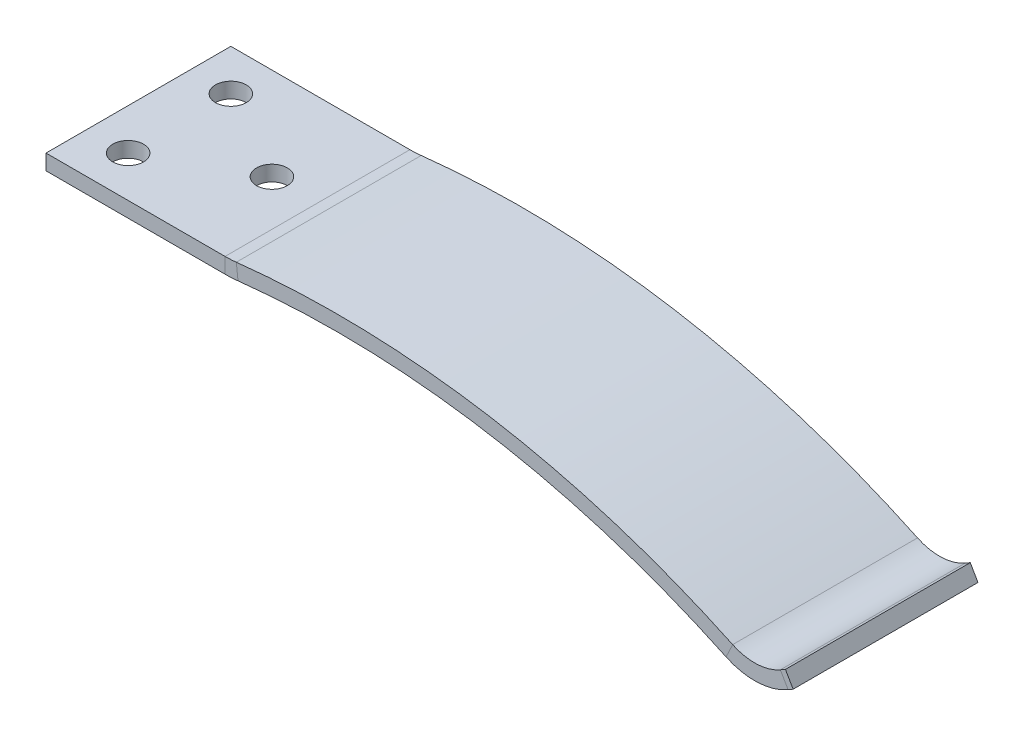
ISO-10303-21;
HEADER;
FILE_DESCRIPTION(('STEP AP214'),'2;1');
FILE_NAME('part.step','',(''),(''),'','','');
FILE_SCHEMA(('AUTOMOTIVE_DESIGN { 1 0 10303 214 1 1 1 1 }'));
ENDSEC;
DATA;
#1=APPLICATION_CONTEXT('core data for automotive mechanical design processes');
#2=APPLICATION_PROTOCOL_DEFINITION('international standard','automotive_design',2000,#1);
#3=PRODUCT_CONTEXT('',#1,'mechanical');
#4=PRODUCT('Part','Part','',(#3));
#5=PRODUCT_RELATED_PRODUCT_CATEGORY('part','',(#4));
#6=PRODUCT_DEFINITION_FORMATION('','',#4);
#7=PRODUCT_DEFINITION_CONTEXT('part definition',#1,'design');
#8=PRODUCT_DEFINITION('design','',#6,#7);
#9=PRODUCT_DEFINITION_SHAPE('','',#8);
#10=(LENGTH_UNIT() NAMED_UNIT(*) SI_UNIT(.MILLI.,.METRE.));
#11=(NAMED_UNIT(*) PLANE_ANGLE_UNIT() SI_UNIT($,.RADIAN.));
#12=(NAMED_UNIT(*) SI_UNIT($,.STERADIAN.) SOLID_ANGLE_UNIT());
#13=UNCERTAINTY_MEASURE_WITH_UNIT(LENGTH_MEASURE(1.E-05),#10,'distance_accuracy_value','');
#14=(GEOMETRIC_REPRESENTATION_CONTEXT(3) GLOBAL_UNCERTAINTY_ASSIGNED_CONTEXT((#13)) GLOBAL_UNIT_ASSIGNED_CONTEXT((#10,
#11,#12)) REPRESENTATION_CONTEXT('',''));
#15=CARTESIAN_POINT('',(0.,0.,0.));
#16=DIRECTION('',(0.,0.,1.));
#17=DIRECTION('',(1.,0.,0.));
#18=AXIS2_PLACEMENT_3D('',#15,#16,#17);
#19=CARTESIAN_POINT('',(17.434693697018,-1.5,9.));
#20=DIRECTION('',(0.,0.,1.));
#21=DIRECTION('',(1.,0.,0.));
#22=AXIS2_PLACEMENT_3D('',#19,#20,#21);
#23=PLANE('',#22);
#24=DIRECTION('',(0.,1.,0.));
#25=VECTOR('',#24,1.);
#26=CARTESIAN_POINT('',(17.434693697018,-1.5,9.));
#27=LINE('',#26,#25);
#28=CARTESIAN_POINT('',(17.434693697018,-1.5,9.));
#29=VERTEX_POINT('',#28);
#30=CARTESIAN_POINT('',(17.434693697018,0.,9.));
#31=VERTEX_POINT('',#30);
#32=EDGE_CURVE('E11',#29,#31,#27,.T.);
#33=ORIENTED_EDGE('',*,*,#32,.F.);
#34=CARTESIAN_POINT('',(17.434693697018,9.99999999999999,8.99999999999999));
#35=DIRECTION('',(0.,0.,1.));
#36=DIRECTION('',(1.,0.,0.));
#37=AXIS2_PLACEMENT_3D('',#34,#35,#36);
#38=CIRCLE('',#37,11.5);
#39=CARTESIAN_POINT('',(18.6976023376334,-1.43044451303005,9.));
#40=VERTEX_POINT('',#39);
#41=EDGE_CURVE('E147',#29,#40,#38,.T.);
#42=ORIENTED_EDGE('',*,*,#41,.T.);
#43=DIRECTION('',(-0.109818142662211,0.993951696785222,0.));
#44=VECTOR('',#43,1.);
#45=CARTESIAN_POINT('',(18.6976023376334,-1.43044451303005,9.));
#46=LINE('',#45,#44);
#47=CARTESIAN_POINT('',(18.5328751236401,0.0604830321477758,9.));
#48=VERTEX_POINT('',#47);
#49=EDGE_CURVE('E132',#40,#48,#46,.T.);
#50=ORIENTED_EDGE('',*,*,#49,.T.);
#51=CARTESIAN_POINT('',(17.434693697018,9.99999999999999,8.99999999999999));
#52=DIRECTION('',(0.,0.,1.));
#53=DIRECTION('',(-1.,0.,0.));
#54=AXIS2_PLACEMENT_3D('',#51,#52,#53);
#55=CIRCLE('',#54,9.99999999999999);
#56=EDGE_CURVE('E263',#31,#48,#55,.T.);
#57=ORIENTED_EDGE('',*,*,#56,.F.);
#58=EDGE_LOOP('',(#33,#42,#50,#57));
#59=FACE_BOUND('',#58,.T.);
#60=ADVANCED_FACE('F33',(#59),#23,.T.);
#61=CARTESIAN_POINT('',(17.434693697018,0.,-9.));
#62=DIRECTION('',(0.,0.,-1.));
#63=DIRECTION('',(-1.,0.,0.));
#64=AXIS2_PLACEMENT_3D('',#61,#62,#63);
#65=PLANE('',#64);
#66=DIRECTION('',(0.,-1.,0.));
#67=VECTOR('',#66,1.);
#68=CARTESIAN_POINT('',(17.434693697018,0.,-9.));
#69=LINE('',#68,#67);
#70=CARTESIAN_POINT('',(17.434693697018,0.,-9.));
#71=VERTEX_POINT('',#70);
#72=CARTESIAN_POINT('',(17.434693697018,-1.5,-9.));
#73=VERTEX_POINT('',#72);
#74=EDGE_CURVE('E42',#71,#73,#69,.T.);
#75=ORIENTED_EDGE('',*,*,#74,.F.);
#76=CARTESIAN_POINT('',(17.434693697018,9.99999999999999,-9.));
#77=DIRECTION('',(0.,0.,1.));
#78=DIRECTION('',(-1.,0.,0.));
#79=AXIS2_PLACEMENT_3D('',#76,#77,#78);
#80=CIRCLE('',#79,9.99999999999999);
#81=CARTESIAN_POINT('',(18.5328751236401,0.0604830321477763,-9.));
#82=VERTEX_POINT('',#81);
#83=EDGE_CURVE('E187',#71,#82,#80,.T.);
#84=ORIENTED_EDGE('',*,*,#83,.T.);
#85=DIRECTION('',(0.109818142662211,-0.993951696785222,0.));
#86=VECTOR('',#85,1.);
#87=CARTESIAN_POINT('',(18.5328751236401,0.0604830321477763,-9.));
#88=LINE('',#87,#86);
#89=CARTESIAN_POINT('',(18.6976023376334,-1.43044451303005,-9.));
#90=VERTEX_POINT('',#89);
#91=EDGE_CURVE('E144',#82,#90,#88,.T.);
#92=ORIENTED_EDGE('',*,*,#91,.T.);
#93=CARTESIAN_POINT('',(17.434693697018,9.99999999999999,-9.));
#94=DIRECTION('',(0.,0.,1.));
#95=DIRECTION('',(1.,0.,0.));
#96=AXIS2_PLACEMENT_3D('',#93,#94,#95);
#97=CIRCLE('',#96,11.5);
#98=EDGE_CURVE('E159',#73,#90,#97,.T.);
#99=ORIENTED_EDGE('',*,*,#98,.F.);
#100=EDGE_LOOP('',(#75,#84,#92,#99));
#101=FACE_BOUND('',#100,.T.);
#102=ADVANCED_FACE('F281',(#101),#65,.T.);
#103=CARTESIAN_POINT('',(18.6976023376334,-1.43044451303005,9.));
#104=DIRECTION('',(0.,0.,1.));
#105=DIRECTION('',(1.,0.,0.));
#106=AXIS2_PLACEMENT_3D('',#103,#104,#105);
#107=PLANE('',#106);
#108=ORIENTED_EDGE('',*,*,#49,.F.);
#109=CARTESIAN_POINT('',(28.4165079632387,-89.3951696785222,9.));
#110=DIRECTION('',(0.,0.,1.));
#111=DIRECTION('',(1.,0.,0.));
#112=AXIS2_PLACEMENT_3D('',#109,#110,#111);
#113=CIRCLE('',#112,88.5);
#114=CARTESIAN_POINT('',(66.2232347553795,-9.37703792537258,9.));
#115=VERTEX_POINT('',#114);
#116=EDGE_CURVE('E136',#40,#115,#113,.F.);
#117=ORIENTED_EDGE('',*,*,#116,.T.);
#118=DIRECTION('',(0.427194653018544,0.904159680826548,0.));
#119=VECTOR('',#118,1.);
#120=CARTESIAN_POINT('',(66.2232347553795,-9.37703792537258,9.));
#121=LINE('',#120,#119);
#122=CARTESIAN_POINT('',(66.8640267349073,-8.02079840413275,9.));
#123=VERTEX_POINT('',#122);
#124=EDGE_CURVE('E230',#115,#123,#121,.T.);
#125=ORIENTED_EDGE('',*,*,#124,.T.);
#126=CARTESIAN_POINT('',(28.4165079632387,-89.3951696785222,9.));
#127=DIRECTION('',(0.,0.,-1.));
#128=DIRECTION('',(-1.,0.,0.));
#129=AXIS2_PLACEMENT_3D('',#126,#127,#128);
#130=CIRCLE('',#129,90.);
#131=EDGE_CURVE('E139',#48,#123,#130,.T.);
#132=ORIENTED_EDGE('',*,*,#131,.F.);
#133=EDGE_LOOP('',(#108,#117,#125,#132));
#134=FACE_BOUND('',#133,.T.);
#135=ADVANCED_FACE('F134',(#134),#107,.T.);
#136=CARTESIAN_POINT('',(18.5328751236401,0.0604830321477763,-9.));
#137=DIRECTION('',(0.,0.,-1.));
#138=DIRECTION('',(-1.,0.,0.));
#139=AXIS2_PLACEMENT_3D('',#136,#137,#138);
#140=PLANE('',#139);
#141=ORIENTED_EDGE('',*,*,#91,.F.);
#142=CARTESIAN_POINT('',(28.4165079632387,-89.3951696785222,-9.));
#143=DIRECTION('',(0.,0.,-1.));
#144=DIRECTION('',(-1.,0.,0.));
#145=AXIS2_PLACEMENT_3D('',#142,#143,#144);
#146=CIRCLE('',#145,90.);
#147=CARTESIAN_POINT('',(66.8640267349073,-8.02079840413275,-9.));
#148=VERTEX_POINT('',#147);
#149=EDGE_CURVE('E185',#82,#148,#146,.T.);
#150=ORIENTED_EDGE('',*,*,#149,.T.);
#151=DIRECTION('',(-0.427194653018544,-0.904159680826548,0.));
#152=VECTOR('',#151,1.);
#153=CARTESIAN_POINT('',(66.8640267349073,-8.02079840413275,-9.));
#154=LINE('',#153,#152);
#155=CARTESIAN_POINT('',(66.2232347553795,-9.37703792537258,-9.));
#156=VERTEX_POINT('',#155);
#157=EDGE_CURVE('E92',#148,#156,#154,.T.);
#158=ORIENTED_EDGE('',*,*,#157,.T.);
#159=CARTESIAN_POINT('',(28.4165079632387,-89.3951696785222,-9.));
#160=DIRECTION('',(0.,0.,1.));
#161=DIRECTION('',(1.,0.,0.));
#162=AXIS2_PLACEMENT_3D('',#159,#160,#161);
#163=CIRCLE('',#162,88.5);
#164=EDGE_CURVE('E200',#90,#156,#163,.F.);
#165=ORIENTED_EDGE('',*,*,#164,.F.);
#166=EDGE_LOOP('',(#141,#150,#158,#165));
#167=FACE_BOUND('',#166,.T.);
#168=ADVANCED_FACE('F283',(#167),#140,.T.);
#169=CARTESIAN_POINT('',(71.5085107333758,-7.82520218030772,8.99999999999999));
#170=DIRECTION('',(0.,0.,1.));
#171=DIRECTION('',(1.,0.,0.));
#172=AXIS2_PLACEMENT_3D('',#169,#170,#171);
#173=PLANE('',#172);
#174=DIRECTION('',(0.501702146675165,-0.865040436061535,0.));
#175=VECTOR('',#174,1.);
#176=CARTESIAN_POINT('',(71.5085107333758,-7.82520218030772,8.99999999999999));
#177=LINE('',#176,#175);
#178=CARTESIAN_POINT('',(71.5085107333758,-7.82520218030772,8.99999999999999));
#179=VERTEX_POINT('',#178);
#180=CARTESIAN_POINT('',(72.2610639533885,-9.12276283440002,9.));
#181=VERTEX_POINT('',#180);
#182=EDGE_CURVE('E51',#179,#181,#177,.T.);
#183=ORIENTED_EDGE('',*,*,#182,.F.);
#184=CARTESIAN_POINT('',(69.,-3.5,9.));
#185=DIRECTION('',(0.,0.,1.));
#186=DIRECTION('',(1.,0.,0.));
#187=AXIS2_PLACEMENT_3D('',#184,#185,#186);
#188=CIRCLE('',#187,5.00000000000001);
#189=EDGE_CURVE('E259',#123,#179,#188,.T.);
#190=ORIENTED_EDGE('',*,*,#189,.F.);
#191=ORIENTED_EDGE('',*,*,#124,.F.);
#192=CARTESIAN_POINT('',(69.,-3.5,9.));
#193=DIRECTION('',(0.,0.,1.));
#194=DIRECTION('',(1.,0.,0.));
#195=AXIS2_PLACEMENT_3D('',#192,#193,#194);
#196=CIRCLE('',#195,6.50000000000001);
#197=EDGE_CURVE('E167',#115,#181,#196,.T.);
#198=ORIENTED_EDGE('',*,*,#197,.T.);
#199=EDGE_LOOP('',(#183,#190,#191,#198));
#200=FACE_BOUND('',#199,.T.);
#201=ADVANCED_FACE('F330',(#200),#173,.T.);
#202=CARTESIAN_POINT('',(66.2232347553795,-9.37703792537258,9.));
#203=DIRECTION('',(0.,0.,1.));
#204=DIRECTION('',(1.,0.,0.));
#205=AXIS2_PLACEMENT_3D('',#202,#203,#204);
#206=PLANE('',#205);
#207=DIRECTION('',(0.865040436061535,0.501702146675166,0.));
#208=VECTOR('',#207,1.);
#209=CARTESIAN_POINT('',(71.5085107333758,-7.82520218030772,8.99999999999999));
#210=LINE('',#209,#208);
#211=CARTESIAN_POINT('',(72.,-7.54015051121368,9.));
#212=VERTEX_POINT('',#211);
#213=EDGE_CURVE('E256',#179,#212,#210,.T.);
#214=ORIENTED_EDGE('',*,*,#213,.F.);
#215=ORIENTED_EDGE('',*,*,#182,.T.);
#216=DIRECTION('',(0.865040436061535,0.501702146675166,0.));
#217=VECTOR('',#216,1.);
#218=CARTESIAN_POINT('',(72.2610639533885,-9.12276283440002,9.));
#219=LINE('',#218,#217);
#220=CARTESIAN_POINT('',(72.7525532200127,-8.83771116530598,9.));
#221=VERTEX_POINT('',#220);
#222=EDGE_CURVE('E105',#181,#221,#219,.T.);
#223=ORIENTED_EDGE('',*,*,#222,.T.);
#224=DIRECTION('',(0.501702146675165,-0.865040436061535,0.));
#225=VECTOR('',#224,1.);
#226=CARTESIAN_POINT('',(72.,-7.54015051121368,9.));
#227=LINE('',#226,#225);
#228=EDGE_CURVE('E253',#212,#221,#227,.T.);
#229=ORIENTED_EDGE('',*,*,#228,.F.);
#230=EDGE_LOOP('',(#214,#215,#223,#229));
#231=FACE_BOUND('',#230,.T.);
#232=ADVANCED_FACE('F308',(#231),#206,.T.);
#233=CARTESIAN_POINT('',(66.8640267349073,-8.02079840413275,-9.));
#234=DIRECTION('',(0.,0.,-1.));
#235=DIRECTION('',(-1.,0.,0.));
#236=AXIS2_PLACEMENT_3D('',#233,#234,#235);
#237=PLANE('',#236);
#238=ORIENTED_EDGE('',*,*,#157,.F.);
#239=CARTESIAN_POINT('',(69.,-3.5,-9.));
#240=DIRECTION('',(0.,0.,1.));
#241=DIRECTION('',(1.,0.,0.));
#242=AXIS2_PLACEMENT_3D('',#239,#240,#241);
#243=CIRCLE('',#242,5.00000000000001);
#244=CARTESIAN_POINT('',(71.5085107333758,-7.82520218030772,-9.));
#245=VERTEX_POINT('',#244);
#246=EDGE_CURVE('E183',#148,#245,#243,.T.);
#247=ORIENTED_EDGE('',*,*,#246,.T.);
#248=DIRECTION('',(-0.501702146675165,0.865040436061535,0.));
#249=VECTOR('',#248,1.);
#250=CARTESIAN_POINT('',(72.2610639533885,-9.12276283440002,-9.));
#251=LINE('',#250,#249);
#252=CARTESIAN_POINT('',(72.2610639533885,-9.12276283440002,-9.));
#253=VERTEX_POINT('',#252);
#254=EDGE_CURVE('E99',#253,#245,#251,.T.);
#255=ORIENTED_EDGE('',*,*,#254,.F.);
#256=CARTESIAN_POINT('',(69.,-3.5,-9.));
#257=DIRECTION('',(0.,0.,1.));
#258=DIRECTION('',(1.,0.,0.));
#259=AXIS2_PLACEMENT_3D('',#256,#257,#258);
#260=CIRCLE('',#259,6.50000000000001);
#261=EDGE_CURVE('E202',#156,#253,#260,.T.);
#262=ORIENTED_EDGE('',*,*,#261,.F.);
#263=EDGE_LOOP('',(#238,#247,#255,#262));
#264=FACE_BOUND('',#263,.T.);
#265=ADVANCED_FACE('F296',(#264),#237,.T.);
#266=CARTESIAN_POINT('',(72.2610639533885,-9.12276283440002,-9.));
#267=DIRECTION('',(0.,0.,-1.));
#268=DIRECTION('',(-1.,0.,0.));
#269=AXIS2_PLACEMENT_3D('',#266,#267,#268);
#270=PLANE('',#269);
#271=DIRECTION('',(1.,0.,0.));
#272=VECTOR('',#271,1.);
#273=CARTESIAN_POINT('',(0.,0.,-9.));
#274=LINE('',#273,#272);
#275=CARTESIAN_POINT('',(0.,0.,-9.));
#276=VERTEX_POINT('',#275);
#277=EDGE_CURVE('E190',#276,#71,#274,.T.);
#278=ORIENTED_EDGE('',*,*,#277,.T.);
#279=ORIENTED_EDGE('',*,*,#74,.T.);
#280=DIRECTION('',(1.,0.,0.));
#281=VECTOR('',#280,1.);
#282=CARTESIAN_POINT('',(0.,-1.5,-9.));
#283=LINE('',#282,#281);
#284=CARTESIAN_POINT('',(0.,-1.5,-9.));
#285=VERTEX_POINT('',#284);
#286=EDGE_CURVE('E196',#285,#73,#283,.T.);
#287=ORIENTED_EDGE('',*,*,#286,.F.);
#288=DIRECTION('',(0.,1.,0.));
#289=VECTOR('',#288,1.);
#290=CARTESIAN_POINT('',(0.,-1.5,-9.));
#291=LINE('',#290,#289);
#292=EDGE_CURVE('E193',#285,#276,#291,.T.);
#293=ORIENTED_EDGE('',*,*,#292,.T.);
#294=EDGE_LOOP('',(#278,#279,#287,#293));
#295=FACE_BOUND('',#294,.T.);
#296=ADVANCED_FACE('F338',(#295),#270,.T.);
#297=CARTESIAN_POINT('',(72.2610639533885,-9.12276283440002,9.));
#298=DIRECTION('',(-0.501702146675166,0.865040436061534,0.));
#299=DIRECTION('',(-0.865040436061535,-0.501702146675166,0.));
#300=AXIS2_PLACEMENT_3D('',#297,#298,#299);
#301=PLANE('',#300);
#302=DIRECTION('',(0.865040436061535,0.501702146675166,0.));
#303=VECTOR('',#302,1.);
#304=CARTESIAN_POINT('',(72.2610639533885,-9.12276283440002,-9.));
#305=LINE('',#304,#303);
#306=CARTESIAN_POINT('',(72.7525532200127,-8.83771116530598,-9.));
#307=VERTEX_POINT('',#306);
#308=EDGE_CURVE('E173',#253,#307,#305,.T.);
#309=ORIENTED_EDGE('',*,*,#308,.T.);
#310=DIRECTION('',(0.,0.,-1.));
#311=VECTOR('',#310,1.);
#312=CARTESIAN_POINT('',(72.7525532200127,-8.83771116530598,9.));
#313=LINE('',#312,#311);
#314=EDGE_CURVE('E226',#221,#307,#313,.T.);
#315=ORIENTED_EDGE('',*,*,#314,.F.);
#316=ORIENTED_EDGE('',*,*,#222,.F.);
#317=DIRECTION('',(0.,0.,-1.));
#318=VECTOR('',#317,1.);
#319=CARTESIAN_POINT('',(72.2610639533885,-9.12276283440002,9.));
#320=LINE('',#319,#318);
#321=EDGE_CURVE('E169',#181,#253,#320,.T.);
#322=ORIENTED_EDGE('',*,*,#321,.T.);
#323=EDGE_LOOP('',(#309,#315,#316,#322));
#324=FACE_BOUND('',#323,.T.);
#325=ADVANCED_FACE('F302',(#324),#301,.F.);
#326=CARTESIAN_POINT('',(72.,-7.54015051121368,9.));
#327=DIRECTION('',(0.865040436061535,0.501702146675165,0.));
#328=DIRECTION('',(-0.501702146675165,0.865040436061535,0.));
#329=AXIS2_PLACEMENT_3D('',#326,#327,#328);
#330=PLANE('',#329);
#331=DIRECTION('',(0.501702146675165,-0.865040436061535,0.));
#332=VECTOR('',#331,1.);
#333=CARTESIAN_POINT('',(72.,-7.54015051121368,-9.));
#334=LINE('',#333,#332);
#335=CARTESIAN_POINT('',(72.,-7.54015051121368,-9.));
#336=VERTEX_POINT('',#335);
#337=EDGE_CURVE('E176',#336,#307,#334,.T.);
#338=ORIENTED_EDGE('',*,*,#337,.F.);
#339=DIRECTION('',(0.,0.,-1.));
#340=VECTOR('',#339,1.);
#341=CARTESIAN_POINT('',(72.,-7.54015051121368,9.));
#342=LINE('',#341,#340);
#343=EDGE_CURVE('E224',#212,#336,#342,.T.);
#344=ORIENTED_EDGE('',*,*,#343,.F.);
#345=ORIENTED_EDGE('',*,*,#228,.T.);
#346=ORIENTED_EDGE('',*,*,#314,.T.);
#347=EDGE_LOOP('',(#338,#344,#345,#346));
#348=FACE_BOUND('',#347,.T.);
#349=ADVANCED_FACE('F307',(#348),#330,.T.);
#350=CARTESIAN_POINT('',(71.5085107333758,-7.82520218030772,8.99999999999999));
#351=DIRECTION('',(-0.501702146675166,0.865040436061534,0.));
#352=DIRECTION('',(-0.865040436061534,-0.501702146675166,0.));
#353=AXIS2_PLACEMENT_3D('',#350,#351,#352);
#354=PLANE('',#353);
#355=DIRECTION('',(0.865040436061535,0.501702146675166,0.));
#356=VECTOR('',#355,1.);
#357=CARTESIAN_POINT('',(71.5085107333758,-7.82520218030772,-9.));
#358=LINE('',#357,#356);
#359=EDGE_CURVE('E180',#245,#336,#358,.T.);
#360=ORIENTED_EDGE('',*,*,#359,.F.);
#361=DIRECTION('',(0.,0.,-1.));
#362=VECTOR('',#361,1.);
#363=CARTESIAN_POINT('',(71.5085107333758,-7.82520218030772,8.99999999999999));
#364=LINE('',#363,#362);
#365=EDGE_CURVE('E221',#179,#245,#364,.T.);
#366=ORIENTED_EDGE('',*,*,#365,.F.);
#367=ORIENTED_EDGE('',*,*,#213,.T.);
#368=ORIENTED_EDGE('',*,*,#343,.T.);
#369=EDGE_LOOP('',(#360,#366,#367,#368));
#370=FACE_BOUND('',#369,.T.);
#371=ADVANCED_FACE('F310',(#370),#354,.T.);
#372=CARTESIAN_POINT('',(69.,-3.5,9.));
#373=DIRECTION('',(0.,0.,-1.));
#374=DIRECTION('',(-1.,0.,0.));
#375=AXIS2_PLACEMENT_3D('',#372,#373,#374);
#376=CYLINDRICAL_SURFACE('',#375,5.00000000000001);
#377=ORIENTED_EDGE('',*,*,#246,.F.);
#378=DIRECTION('',(0.,0.,-1.));
#379=VECTOR('',#378,1.);
#380=CARTESIAN_POINT('',(66.8640267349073,-8.02079840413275,9.));
#381=LINE('',#380,#379);
#382=EDGE_CURVE('E218',#123,#148,#381,.T.);
#383=ORIENTED_EDGE('',*,*,#382,.F.);
#384=ORIENTED_EDGE('',*,*,#189,.T.);
#385=ORIENTED_EDGE('',*,*,#365,.T.);
#386=EDGE_LOOP('',(#377,#383,#384,#385));
#387=FACE_BOUND('',#386,.T.);
#388=ADVANCED_FACE('F293',(#387),#376,.F.);
#389=CARTESIAN_POINT('',(28.4165079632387,-89.3951696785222,9.));
#390=DIRECTION('',(0.,0.,-1.));
#391=DIRECTION('',(-1.,0.,0.));
#392=AXIS2_PLACEMENT_3D('',#389,#390,#391);
#393=CYLINDRICAL_SURFACE('',#392,90.);
#394=ORIENTED_EDGE('',*,*,#149,.F.);
#395=DIRECTION('',(0.,0.,-1.));
#396=VECTOR('',#395,1.);
#397=CARTESIAN_POINT('',(18.5328751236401,0.0604830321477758,9.));
#398=LINE('',#397,#396);
#399=EDGE_CURVE('E215',#48,#82,#398,.T.);
#400=ORIENTED_EDGE('',*,*,#399,.F.);
#401=ORIENTED_EDGE('',*,*,#131,.T.);
#402=ORIENTED_EDGE('',*,*,#382,.T.);
#403=EDGE_LOOP('',(#394,#400,#401,#402));
#404=FACE_BOUND('',#403,.T.);
#405=ADVANCED_FACE('F288',(#404),#393,.T.);
#406=CARTESIAN_POINT('',(17.434693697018,9.99999999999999,8.99999999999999));
#407=DIRECTION('',(0.,0.,-1.));
#408=DIRECTION('',(-1.,0.,0.));
#409=AXIS2_PLACEMENT_3D('',#406,#407,#408);
#410=CYLINDRICAL_SURFACE('',#409,9.99999999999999);
#411=ORIENTED_EDGE('',*,*,#83,.F.);
#412=DIRECTION('',(0.,0.,-1.));
#413=VECTOR('',#412,1.);
#414=CARTESIAN_POINT('',(17.434693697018,0.,9.));
#415=LINE('',#414,#413);
#416=EDGE_CURVE('E212',#31,#71,#415,.T.);
#417=ORIENTED_EDGE('',*,*,#416,.F.);
#418=ORIENTED_EDGE('',*,*,#56,.T.);
#419=ORIENTED_EDGE('',*,*,#399,.T.);
#420=EDGE_LOOP('',(#411,#417,#418,#419));
#421=FACE_BOUND('',#420,.T.);
#422=ADVANCED_FACE('F286',(#421),#410,.F.);
#423=CARTESIAN_POINT('',(0.,0.,9.));
#424=DIRECTION('',(0.,1.,0.));
#425=DIRECTION('',(0.,0.,1.));
#426=AXIS2_PLACEMENT_3D('',#423,#424,#425);
#427=PLANE('',#426);
#428=CARTESIAN_POINT('',(4.,0.,5.));
#429=DIRECTION('',(0.,1.,0.));
#430=DIRECTION('',(0.,0.,1.));
#431=AXIS2_PLACEMENT_3D('',#428,#429,#430);
#432=CIRCLE('',#431,1.5);
#433=CARTESIAN_POINT('',(4.,0.,6.5));
#434=VERTEX_POINT('',#433);
#435=EDGE_CURVE('E249',#434,#434,#432,.T.);
#436=ORIENTED_EDGE('',*,*,#435,.F.);
#437=EDGE_LOOP('',(#436));
#438=FACE_BOUND('',#437,.T.);
#439=CARTESIAN_POINT('',(4.,0.,-5.));
#440=DIRECTION('',(0.,1.,0.));
#441=DIRECTION('',(0.,0.,-1.));
#442=AXIS2_PLACEMENT_3D('',#439,#440,#441);
#443=CIRCLE('',#442,1.5);
#444=CARTESIAN_POINT('',(4.,0.,-3.5));
#445=VERTEX_POINT('',#444);
#446=EDGE_CURVE('E239',#445,#445,#443,.T.);
#447=ORIENTED_EDGE('',*,*,#446,.F.);
#448=EDGE_LOOP('',(#447));
#449=FACE_BOUND('',#448,.T.);
#450=CARTESIAN_POINT('',(13.,0.,0.));
#451=DIRECTION('',(0.,1.,0.));
#452=DIRECTION('',(0.,0.,1.));
#453=AXIS2_PLACEMENT_3D('',#450,#451,#452);
#454=CIRCLE('',#453,1.5);
#455=CARTESIAN_POINT('',(13.,0.,1.49999999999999));
#456=VERTEX_POINT('',#455);
#457=EDGE_CURVE('E236',#456,#456,#454,.T.);
#458=ORIENTED_EDGE('',*,*,#457,.F.);
#459=EDGE_LOOP('',(#458));
#460=FACE_BOUND('',#459,.T.);
#461=ORIENTED_EDGE('',*,*,#277,.F.);
#462=DIRECTION('',(0.,0.,-1.));
#463=VECTOR('',#462,1.);
#464=CARTESIAN_POINT('',(0.,0.,9.));
#465=LINE('',#464,#463);
#466=CARTESIAN_POINT('',(0.,0.,9.));
#467=VERTEX_POINT('',#466);
#468=EDGE_CURVE('E210',#467,#276,#465,.T.);
#469=ORIENTED_EDGE('',*,*,#468,.F.);
#470=DIRECTION('',(1.,0.,0.));
#471=VECTOR('',#470,1.);
#472=CARTESIAN_POINT('',(0.,0.,9.));
#473=LINE('',#472,#471);
#474=EDGE_CURVE('E265',#467,#31,#473,.T.);
#475=ORIENTED_EDGE('',*,*,#474,.T.);
#476=ORIENTED_EDGE('',*,*,#416,.T.);
#477=EDGE_LOOP('',(#461,#469,#475,#476));
#478=FACE_BOUND('',#477,.T.);
#479=ADVANCED_FACE('F385',(#438,#449,#460,#478),#427,.T.);
#480=CARTESIAN_POINT('',(0.,-1.5,9.));
#481=DIRECTION('',(-1.,0.,0.));
#482=DIRECTION('',(0.,0.,1.));
#483=AXIS2_PLACEMENT_3D('',#480,#481,#482);
#484=PLANE('',#483);
#485=ORIENTED_EDGE('',*,*,#292,.F.);
#486=DIRECTION('',(0.,0.,-1.));
#487=VECTOR('',#486,1.);
#488=CARTESIAN_POINT('',(0.,-1.5,9.));
#489=LINE('',#488,#487);
#490=CARTESIAN_POINT('',(0.,-1.5,9.));
#491=VERTEX_POINT('',#490);
#492=EDGE_CURVE('E208',#491,#285,#489,.T.);
#493=ORIENTED_EDGE('',*,*,#492,.F.);
#494=DIRECTION('',(0.,1.,0.));
#495=VECTOR('',#494,1.);
#496=CARTESIAN_POINT('',(0.,-1.5,9.));
#497=LINE('',#496,#495);
#498=EDGE_CURVE('E268',#491,#467,#497,.T.);
#499=ORIENTED_EDGE('',*,*,#498,.T.);
#500=ORIENTED_EDGE('',*,*,#468,.T.);
#501=EDGE_LOOP('',(#485,#493,#499,#500));
#502=FACE_BOUND('',#501,.T.);
#503=ADVANCED_FACE('F395',(#502),#484,.T.);
#504=CARTESIAN_POINT('',(0.,-1.5,9.));
#505=DIRECTION('',(0.,1.,0.));
#506=DIRECTION('',(0.,0.,1.));
#507=AXIS2_PLACEMENT_3D('',#504,#505,#506);
#508=PLANE('',#507);
#509=CARTESIAN_POINT('',(4.,-1.5,5.));
#510=DIRECTION('',(0.,1.,0.));
#511=DIRECTION('',(0.,0.,1.));
#512=AXIS2_PLACEMENT_3D('',#509,#510,#511);
#513=CIRCLE('',#512,1.5);
#514=CARTESIAN_POINT('',(4.,-1.5,6.5));
#515=VERTEX_POINT('',#514);
#516=EDGE_CURVE('E36',#515,#515,#513,.T.);
#517=ORIENTED_EDGE('',*,*,#516,.T.);
#518=EDGE_LOOP('',(#517));
#519=FACE_BOUND('',#518,.T.);
#520=CARTESIAN_POINT('',(4.,-1.5,-5.));
#521=DIRECTION('',(0.,1.,0.));
#522=DIRECTION('',(0.,0.,1.));
#523=AXIS2_PLACEMENT_3D('',#520,#521,#522);
#524=CIRCLE('',#523,1.5);
#525=CARTESIAN_POINT('',(4.,-1.5,-3.5));
#526=VERTEX_POINT('',#525);
#527=EDGE_CURVE('E237',#526,#526,#524,.T.);
#528=ORIENTED_EDGE('',*,*,#527,.T.);
#529=EDGE_LOOP('',(#528));
#530=FACE_BOUND('',#529,.T.);
#531=CARTESIAN_POINT('',(13.,-1.5,0.));
#532=DIRECTION('',(0.,1.,0.));
#533=DIRECTION('',(0.,0.,1.));
#534=AXIS2_PLACEMENT_3D('',#531,#532,#533);
#535=CIRCLE('',#534,1.5);
#536=CARTESIAN_POINT('',(13.,-1.5,1.49999999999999));
#537=VERTEX_POINT('',#536);
#538=EDGE_CURVE('E177',#537,#537,#535,.T.);
#539=ORIENTED_EDGE('',*,*,#538,.T.);
#540=EDGE_LOOP('',(#539));
#541=FACE_BOUND('',#540,.T.);
#542=ORIENTED_EDGE('',*,*,#286,.T.);
#543=DIRECTION('',(0.,0.,-1.));
#544=VECTOR('',#543,1.);
#545=CARTESIAN_POINT('',(17.434693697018,-1.5,9.));
#546=LINE('',#545,#544);
#547=EDGE_CURVE('E161',#29,#73,#546,.T.);
#548=ORIENTED_EDGE('',*,*,#547,.F.);
#549=DIRECTION('',(1.,0.,0.));
#550=VECTOR('',#549,1.);
#551=CARTESIAN_POINT('',(0.,-1.5,9.));
#552=LINE('',#551,#550);
#553=EDGE_CURVE('E152',#491,#29,#552,.T.);
#554=ORIENTED_EDGE('',*,*,#553,.F.);
#555=ORIENTED_EDGE('',*,*,#492,.T.);
#556=EDGE_LOOP('',(#542,#548,#554,#555));
#557=FACE_BOUND('',#556,.T.);
#558=ADVANCED_FACE('F278',(#519,#530,#541,#557),#508,.F.);
#559=CARTESIAN_POINT('',(17.434693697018,9.99999999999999,8.99999999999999));
#560=DIRECTION('',(0.,0.,-1.));
#561=DIRECTION('',(-1.,0.,0.));
#562=AXIS2_PLACEMENT_3D('',#559,#560,#561);
#563=CYLINDRICAL_SURFACE('',#562,11.5);
#564=ORIENTED_EDGE('',*,*,#98,.T.);
#565=DIRECTION('',(0.,0.,-1.));
#566=VECTOR('',#565,1.);
#567=CARTESIAN_POINT('',(18.6976023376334,-1.43044451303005,9.));
#568=LINE('',#567,#566);
#569=EDGE_CURVE('E156',#40,#90,#568,.T.);
#570=ORIENTED_EDGE('',*,*,#569,.F.);
#571=ORIENTED_EDGE('',*,*,#41,.F.);
#572=ORIENTED_EDGE('',*,*,#547,.T.);
#573=EDGE_LOOP('',(#564,#570,#571,#572));
#574=FACE_BOUND('',#573,.T.);
#575=ADVANCED_FACE('F157',(#574),#563,.T.);
#576=CARTESIAN_POINT('',(28.4165079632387,-89.3951696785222,9.));
#577=DIRECTION('',(0.,0.,-1.));
#578=DIRECTION('',(-1.,0.,0.));
#579=AXIS2_PLACEMENT_3D('',#576,#577,#578);
#580=CYLINDRICAL_SURFACE('',#579,88.5);
#581=ORIENTED_EDGE('',*,*,#164,.T.);
#582=DIRECTION('',(0.,0.,-1.));
#583=VECTOR('',#582,1.);
#584=CARTESIAN_POINT('',(66.2232347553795,-9.37703792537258,9.));
#585=LINE('',#584,#583);
#586=EDGE_CURVE('E162',#115,#156,#585,.T.);
#587=ORIENTED_EDGE('',*,*,#586,.F.);
#588=ORIENTED_EDGE('',*,*,#116,.F.);
#589=ORIENTED_EDGE('',*,*,#569,.T.);
#590=EDGE_LOOP('',(#581,#587,#588,#589));
#591=FACE_BOUND('',#590,.T.);
#592=ADVANCED_FACE('F164',(#591),#580,.F.);
#593=CARTESIAN_POINT('',(69.,-3.5,9.));
#594=DIRECTION('',(0.,0.,-1.));
#595=DIRECTION('',(-1.,0.,0.));
#596=AXIS2_PLACEMENT_3D('',#593,#594,#595);
#597=CYLINDRICAL_SURFACE('',#596,6.50000000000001);
#598=ORIENTED_EDGE('',*,*,#261,.T.);
#599=ORIENTED_EDGE('',*,*,#321,.F.);
#600=ORIENTED_EDGE('',*,*,#197,.F.);
#601=ORIENTED_EDGE('',*,*,#586,.T.);
#602=EDGE_LOOP('',(#598,#599,#600,#601));
#603=FACE_BOUND('',#602,.T.);
#604=ADVANCED_FACE('F299',(#603),#597,.T.);
#605=CARTESIAN_POINT('',(69.,-3.5,9.));
#606=DIRECTION('',(0.,0.,1.));
#607=DIRECTION('',(1.,0.,0.));
#608=AXIS2_PLACEMENT_3D('',#605,#606,#607);
#609=PLANE('',#608);
#610=ORIENTED_EDGE('',*,*,#553,.T.);
#611=ORIENTED_EDGE('',*,*,#32,.T.);
#612=ORIENTED_EDGE('',*,*,#474,.F.);
#613=ORIENTED_EDGE('',*,*,#498,.F.);
#614=EDGE_LOOP('',(#610,#611,#612,#613));
#615=FACE_BOUND('',#614,.T.);
#616=ADVANCED_FACE('F274',(#615),#609,.T.);
#617=CARTESIAN_POINT('',(69.,-3.5,-9.));
#618=DIRECTION('',(0.,0.,1.));
#619=DIRECTION('',(1.,0.,0.));
#620=AXIS2_PLACEMENT_3D('',#617,#618,#619);
#621=PLANE('',#620);
#622=ORIENTED_EDGE('',*,*,#308,.F.);
#623=ORIENTED_EDGE('',*,*,#254,.T.);
#624=ORIENTED_EDGE('',*,*,#359,.T.);
#625=ORIENTED_EDGE('',*,*,#337,.T.);
#626=EDGE_LOOP('',(#622,#623,#624,#625));
#627=FACE_BOUND('',#626,.T.);
#628=ADVANCED_FACE('F304',(#627),#621,.F.);
#629=CARTESIAN_POINT('',(13.,-10.,0.));
#630=DIRECTION('',(0.,1.,0.));
#631=DIRECTION('',(0.,0.,1.));
#632=AXIS2_PLACEMENT_3D('',#629,#630,#631);
#633=CYLINDRICAL_SURFACE('',#632,1.5);
#634=CARTESIAN_POINT('',(13.,0.,1.49999999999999));
#635=CARTESIAN_POINT('',(13.,-0.0156249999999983,1.49999999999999));
#636=CARTESIAN_POINT('',(13.,-0.0312499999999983,1.49999999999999));
#637=CARTESIAN_POINT('',(13.,-0.0624999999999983,1.49999999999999));
#638=CARTESIAN_POINT('',(13.,-0.0781249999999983,1.49999999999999));
#639=CARTESIAN_POINT('',(13.,-0.109374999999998,1.49999999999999));
#640=CARTESIAN_POINT('',(13.,-0.124999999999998,1.49999999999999));
#641=CARTESIAN_POINT('',(13.,-0.156249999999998,1.49999999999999));
#642=CARTESIAN_POINT('',(13.,-0.171874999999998,1.49999999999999));
#643=CARTESIAN_POINT('',(13.,-0.203124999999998,1.49999999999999));
#644=CARTESIAN_POINT('',(13.,-0.218749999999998,1.49999999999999));
#645=CARTESIAN_POINT('',(13.,-0.249999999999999,1.49999999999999));
#646=CARTESIAN_POINT('',(13.,-0.265624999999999,1.49999999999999));
#647=CARTESIAN_POINT('',(13.,-0.296874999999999,1.49999999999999));
#648=CARTESIAN_POINT('',(13.,-0.312499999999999,1.49999999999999));
#649=CARTESIAN_POINT('',(13.,-0.343749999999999,1.49999999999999));
#650=CARTESIAN_POINT('',(13.,-0.359374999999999,1.49999999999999));
#651=CARTESIAN_POINT('',(13.,-0.390624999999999,1.49999999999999));
#652=CARTESIAN_POINT('',(13.,-0.406249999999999,1.49999999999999));
#653=CARTESIAN_POINT('',(13.,-0.437499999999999,1.49999999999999));
#654=CARTESIAN_POINT('',(13.,-0.453124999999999,1.49999999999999));
#655=CARTESIAN_POINT('',(13.,-0.484374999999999,1.49999999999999));
#656=CARTESIAN_POINT('',(13.,-0.499999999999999,1.49999999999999));
#657=CARTESIAN_POINT('',(13.,-0.531249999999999,1.49999999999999));
#658=CARTESIAN_POINT('',(13.,-0.546874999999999,1.49999999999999));
#659=CARTESIAN_POINT('',(13.,-0.578124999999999,1.49999999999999));
#660=CARTESIAN_POINT('',(13.,-0.593749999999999,1.49999999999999));
#661=CARTESIAN_POINT('',(13.,-0.624999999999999,1.49999999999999));
#662=CARTESIAN_POINT('',(13.,-0.640624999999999,1.49999999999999));
#663=CARTESIAN_POINT('',(13.,-0.671874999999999,1.49999999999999));
#664=CARTESIAN_POINT('',(13.,-0.687499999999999,1.49999999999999));
#665=CARTESIAN_POINT('',(13.,-0.718749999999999,1.49999999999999));
#666=CARTESIAN_POINT('',(13.,-0.734374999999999,1.49999999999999));
#667=CARTESIAN_POINT('',(13.,-0.765624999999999,1.49999999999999));
#668=CARTESIAN_POINT('',(13.,-0.781249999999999,1.49999999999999));
#669=CARTESIAN_POINT('',(13.,-0.812499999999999,1.49999999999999));
#670=CARTESIAN_POINT('',(13.,-0.828124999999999,1.49999999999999));
#671=CARTESIAN_POINT('',(13.,-0.859374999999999,1.49999999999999));
#672=CARTESIAN_POINT('',(13.,-0.874999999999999,1.49999999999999));
#673=CARTESIAN_POINT('',(13.,-0.906249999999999,1.49999999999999));
#674=CARTESIAN_POINT('',(13.,-0.921874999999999,1.49999999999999));
#675=CARTESIAN_POINT('',(13.,-0.953124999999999,1.49999999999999));
#676=CARTESIAN_POINT('',(13.,-0.968749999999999,1.49999999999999));
#677=CARTESIAN_POINT('',(13.,-0.999999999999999,1.49999999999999));
#678=CARTESIAN_POINT('',(13.,-1.015625,1.49999999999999));
#679=CARTESIAN_POINT('',(13.,-1.046875,1.49999999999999));
#680=CARTESIAN_POINT('',(13.,-1.0625,1.49999999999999));
#681=CARTESIAN_POINT('',(13.,-1.09375,1.49999999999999));
#682=CARTESIAN_POINT('',(13.,-1.109375,1.49999999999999));
#683=CARTESIAN_POINT('',(13.,-1.140625,1.49999999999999));
#684=CARTESIAN_POINT('',(13.,-1.15625,1.49999999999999));
#685=CARTESIAN_POINT('',(13.,-1.1875,1.49999999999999));
#686=CARTESIAN_POINT('',(13.,-1.203125,1.49999999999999));
#687=CARTESIAN_POINT('',(13.,-1.234375,1.49999999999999));
#688=CARTESIAN_POINT('',(13.,-1.25,1.49999999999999));
#689=CARTESIAN_POINT('',(13.,-1.28125,1.49999999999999));
#690=CARTESIAN_POINT('',(13.,-1.296875,1.49999999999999));
#691=CARTESIAN_POINT('',(13.,-1.328125,1.49999999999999));
#692=CARTESIAN_POINT('',(13.,-1.34375,1.49999999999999));
#693=CARTESIAN_POINT('',(13.,-1.375,1.49999999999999));
#694=CARTESIAN_POINT('',(13.,-1.390625,1.49999999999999));
#695=CARTESIAN_POINT('',(13.,-1.421875,1.49999999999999));
#696=CARTESIAN_POINT('',(13.,-1.4375,1.49999999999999));
#697=CARTESIAN_POINT('',(13.,-1.46875,1.49999999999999));
#698=CARTESIAN_POINT('',(13.,-1.484375,1.49999999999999));
#699=CARTESIAN_POINT('',(13.,-1.5,1.49999999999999));
#700=B_SPLINE_CURVE_WITH_KNOTS('',3,(#634,#635,#636,#637,#638,#639,#640,#641,#642,#643,#644,
#645,#646,#647,#648,#649,#650,#651,#652,#653,#654,#655,#656,#657,#658,#659,#660,#661,#662,#663,
#664,#665,#666,#667,#668,#669,#670,#671,#672,#673,#674,#675,#676,#677,#678,#679,#680,#681,#682,
#683,#684,#685,#686,#687,#688,#689,#690,#691,#692,#693,#694,#695,#696,#697,#698,#699),
.UNSPECIFIED.,.F.,.F.,(4,2,2,2,2,2,2,2,2,2,2,2,2,2,2,2,2,2,2,2,2,2,2,2,2,2,2,2,2,2,2,2,4),(0.,
0.046875,0.0937500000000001,0.140625,0.1875,0.234375,0.28125,0.328125,0.375,0.421875,0.46875,
0.515625,0.5625,0.609375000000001,0.656250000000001,0.703125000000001,0.750000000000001,
0.796875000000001,0.843750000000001,0.890625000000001,0.937500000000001,0.984375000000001,
1.03125,1.078125,1.125,1.171875,1.21875,1.265625,1.3125,1.359375,1.40625,1.453125,1.5),.UNSPECIFIED.);
#701=EDGE_CURVE('BSEAM454',#456,#537,#700,.T.);
#702=ORIENTED_EDGE('',*,*,#457,.T.);
#703=ORIENTED_EDGE('',*,*,#538,.F.);
#704=ORIENTED_EDGE('',*,*,#701,.T.);
#705=ORIENTED_EDGE('',*,*,#701,.F.);
#706=EDGE_LOOP('',(#702,#704,#703,#705));
#707=FACE_BOUND('',#706,.T.);
#708=ADVANCED_FACE('F454',(#707),#633,.F.);
#709=CARTESIAN_POINT('',(4.,-10.,-5.));
#710=DIRECTION('',(0.,1.,0.));
#711=DIRECTION('',(0.,0.,1.));
#712=AXIS2_PLACEMENT_3D('',#709,#710,#711);
#713=CYLINDRICAL_SURFACE('',#712,1.5);
#714=CARTESIAN_POINT('',(4.,0.,-3.5));
#715=CARTESIAN_POINT('',(4.,-0.0156249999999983,-3.5));
#716=CARTESIAN_POINT('',(4.,-0.0312499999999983,-3.5));
#717=CARTESIAN_POINT('',(4.,-0.0624999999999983,-3.5));
#718=CARTESIAN_POINT('',(4.,-0.0781249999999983,-3.5));
#719=CARTESIAN_POINT('',(4.,-0.109374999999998,-3.5));
#720=CARTESIAN_POINT('',(4.,-0.124999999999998,-3.5));
#721=CARTESIAN_POINT('',(4.,-0.156249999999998,-3.5));
#722=CARTESIAN_POINT('',(4.,-0.171874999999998,-3.5));
#723=CARTESIAN_POINT('',(4.,-0.203124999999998,-3.5));
#724=CARTESIAN_POINT('',(4.,-0.218749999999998,-3.5));
#725=CARTESIAN_POINT('',(4.,-0.249999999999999,-3.5));
#726=CARTESIAN_POINT('',(4.,-0.265624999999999,-3.5));
#727=CARTESIAN_POINT('',(4.,-0.296874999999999,-3.5));
#728=CARTESIAN_POINT('',(4.,-0.312499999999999,-3.5));
#729=CARTESIAN_POINT('',(4.,-0.343749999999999,-3.5));
#730=CARTESIAN_POINT('',(4.,-0.359374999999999,-3.5));
#731=CARTESIAN_POINT('',(4.,-0.390624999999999,-3.5));
#732=CARTESIAN_POINT('',(4.,-0.406249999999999,-3.5));
#733=CARTESIAN_POINT('',(4.,-0.437499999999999,-3.5));
#734=CARTESIAN_POINT('',(4.,-0.453124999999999,-3.5));
#735=CARTESIAN_POINT('',(4.,-0.484374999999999,-3.5));
#736=CARTESIAN_POINT('',(4.,-0.499999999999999,-3.5));
#737=CARTESIAN_POINT('',(4.,-0.531249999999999,-3.5));
#738=CARTESIAN_POINT('',(4.,-0.546874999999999,-3.5));
#739=CARTESIAN_POINT('',(4.,-0.578124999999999,-3.5));
#740=CARTESIAN_POINT('',(4.,-0.593749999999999,-3.5));
#741=CARTESIAN_POINT('',(4.,-0.624999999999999,-3.5));
#742=CARTESIAN_POINT('',(4.,-0.640624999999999,-3.5));
#743=CARTESIAN_POINT('',(4.,-0.671874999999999,-3.5));
#744=CARTESIAN_POINT('',(4.,-0.687499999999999,-3.5));
#745=CARTESIAN_POINT('',(4.,-0.718749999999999,-3.5));
#746=CARTESIAN_POINT('',(4.,-0.734374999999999,-3.5));
#747=CARTESIAN_POINT('',(4.,-0.765624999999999,-3.5));
#748=CARTESIAN_POINT('',(4.,-0.781249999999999,-3.5));
#749=CARTESIAN_POINT('',(4.,-0.812499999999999,-3.5));
#750=CARTESIAN_POINT('',(4.,-0.828124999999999,-3.5));
#751=CARTESIAN_POINT('',(4.,-0.859374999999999,-3.5));
#752=CARTESIAN_POINT('',(4.,-0.874999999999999,-3.5));
#753=CARTESIAN_POINT('',(4.,-0.906249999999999,-3.5));
#754=CARTESIAN_POINT('',(4.,-0.921874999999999,-3.5));
#755=CARTESIAN_POINT('',(4.,-0.953124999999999,-3.5));
#756=CARTESIAN_POINT('',(4.,-0.968749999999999,-3.5));
#757=CARTESIAN_POINT('',(4.,-0.999999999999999,-3.5));
#758=CARTESIAN_POINT('',(4.,-1.015625,-3.5));
#759=CARTESIAN_POINT('',(4.,-1.046875,-3.5));
#760=CARTESIAN_POINT('',(4.,-1.0625,-3.5));
#761=CARTESIAN_POINT('',(4.,-1.09375,-3.5));
#762=CARTESIAN_POINT('',(4.,-1.109375,-3.5));
#763=CARTESIAN_POINT('',(4.,-1.140625,-3.5));
#764=CARTESIAN_POINT('',(4.,-1.15625,-3.5));
#765=CARTESIAN_POINT('',(4.,-1.1875,-3.5));
#766=CARTESIAN_POINT('',(4.,-1.203125,-3.5));
#767=CARTESIAN_POINT('',(4.,-1.234375,-3.5));
#768=CARTESIAN_POINT('',(4.,-1.25,-3.5));
#769=CARTESIAN_POINT('',(4.,-1.28125,-3.5));
#770=CARTESIAN_POINT('',(4.,-1.296875,-3.5));
#771=CARTESIAN_POINT('',(4.,-1.328125,-3.5));
#772=CARTESIAN_POINT('',(4.,-1.34375,-3.5));
#773=CARTESIAN_POINT('',(4.,-1.375,-3.5));
#774=CARTESIAN_POINT('',(4.,-1.390625,-3.5));
#775=CARTESIAN_POINT('',(4.,-1.421875,-3.5));
#776=CARTESIAN_POINT('',(4.,-1.4375,-3.5));
#777=CARTESIAN_POINT('',(4.,-1.46875,-3.5));
#778=CARTESIAN_POINT('',(4.,-1.484375,-3.5));
#779=CARTESIAN_POINT('',(4.,-1.5,-3.5));
#780=B_SPLINE_CURVE_WITH_KNOTS('',3,(#714,#715,#716,#717,#718,#719,#720,#721,#722,#723,#724,
#725,#726,#727,#728,#729,#730,#731,#732,#733,#734,#735,#736,#737,#738,#739,#740,#741,#742,#743,
#744,#745,#746,#747,#748,#749,#750,#751,#752,#753,#754,#755,#756,#757,#758,#759,#760,#761,#762,
#763,#764,#765,#766,#767,#768,#769,#770,#771,#772,#773,#774,#775,#776,#777,#778,#779),
.UNSPECIFIED.,.F.,.F.,(4,2,2,2,2,2,2,2,2,2,2,2,2,2,2,2,2,2,2,2,2,2,2,2,2,2,2,2,2,2,2,2,4),(0.,
0.046875,0.0937500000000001,0.140625,0.1875,0.234375,0.28125,0.328125,0.375,0.421875,0.46875,
0.515625,0.5625,0.609375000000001,0.656250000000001,0.703125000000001,0.750000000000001,
0.796875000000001,0.843750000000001,0.890625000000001,0.937500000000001,0.984375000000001,
1.03125,1.078125,1.125,1.171875,1.21875,1.265625,1.3125,1.359375,1.40625,1.453125,1.5),.UNSPECIFIED.);
#781=EDGE_CURVE('BSEAM463',#445,#526,#780,.T.);
#782=ORIENTED_EDGE('',*,*,#446,.T.);
#783=ORIENTED_EDGE('',*,*,#527,.F.);
#784=ORIENTED_EDGE('',*,*,#781,.T.);
#785=ORIENTED_EDGE('',*,*,#781,.F.);
#786=EDGE_LOOP('',(#782,#784,#783,#785));
#787=FACE_BOUND('',#786,.T.);
#788=ADVANCED_FACE('F463',(#787),#713,.F.);
#789=CARTESIAN_POINT('',(4.,-10.,5.));
#790=DIRECTION('',(0.,1.,0.));
#791=DIRECTION('',(0.,0.,1.));
#792=AXIS2_PLACEMENT_3D('',#789,#790,#791);
#793=CYLINDRICAL_SURFACE('',#792,1.5);
#794=CARTESIAN_POINT('',(4.,0.,6.5));
#795=CARTESIAN_POINT('',(4.,-0.0156249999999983,6.5));
#796=CARTESIAN_POINT('',(4.,-0.0312499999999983,6.5));
#797=CARTESIAN_POINT('',(4.,-0.0624999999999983,6.5));
#798=CARTESIAN_POINT('',(4.,-0.0781249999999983,6.5));
#799=CARTESIAN_POINT('',(4.,-0.109374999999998,6.5));
#800=CARTESIAN_POINT('',(4.,-0.124999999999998,6.5));
#801=CARTESIAN_POINT('',(4.,-0.156249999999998,6.5));
#802=CARTESIAN_POINT('',(4.,-0.171874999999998,6.5));
#803=CARTESIAN_POINT('',(4.,-0.203124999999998,6.5));
#804=CARTESIAN_POINT('',(4.,-0.218749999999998,6.5));
#805=CARTESIAN_POINT('',(4.,-0.249999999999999,6.5));
#806=CARTESIAN_POINT('',(4.,-0.265624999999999,6.5));
#807=CARTESIAN_POINT('',(4.,-0.296874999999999,6.5));
#808=CARTESIAN_POINT('',(4.,-0.312499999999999,6.5));
#809=CARTESIAN_POINT('',(4.,-0.343749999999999,6.5));
#810=CARTESIAN_POINT('',(4.,-0.359374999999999,6.5));
#811=CARTESIAN_POINT('',(4.,-0.390624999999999,6.5));
#812=CARTESIAN_POINT('',(4.,-0.406249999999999,6.5));
#813=CARTESIAN_POINT('',(4.,-0.437499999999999,6.5));
#814=CARTESIAN_POINT('',(4.,-0.453124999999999,6.5));
#815=CARTESIAN_POINT('',(4.,-0.484374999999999,6.5));
#816=CARTESIAN_POINT('',(4.,-0.499999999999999,6.5));
#817=CARTESIAN_POINT('',(4.,-0.531249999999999,6.5));
#818=CARTESIAN_POINT('',(4.,-0.546874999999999,6.5));
#819=CARTESIAN_POINT('',(4.,-0.578124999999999,6.5));
#820=CARTESIAN_POINT('',(4.,-0.593749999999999,6.5));
#821=CARTESIAN_POINT('',(4.,-0.624999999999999,6.5));
#822=CARTESIAN_POINT('',(4.,-0.640624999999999,6.5));
#823=CARTESIAN_POINT('',(4.,-0.671874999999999,6.5));
#824=CARTESIAN_POINT('',(4.,-0.687499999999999,6.5));
#825=CARTESIAN_POINT('',(4.,-0.718749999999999,6.5));
#826=CARTESIAN_POINT('',(4.,-0.734374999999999,6.5));
#827=CARTESIAN_POINT('',(4.,-0.765624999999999,6.5));
#828=CARTESIAN_POINT('',(4.,-0.781249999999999,6.5));
#829=CARTESIAN_POINT('',(4.,-0.812499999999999,6.5));
#830=CARTESIAN_POINT('',(4.,-0.828124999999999,6.5));
#831=CARTESIAN_POINT('',(4.,-0.859374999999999,6.5));
#832=CARTESIAN_POINT('',(4.,-0.874999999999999,6.5));
#833=CARTESIAN_POINT('',(4.,-0.906249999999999,6.5));
#834=CARTESIAN_POINT('',(4.,-0.921874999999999,6.5));
#835=CARTESIAN_POINT('',(4.,-0.953124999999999,6.5));
#836=CARTESIAN_POINT('',(4.,-0.968749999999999,6.5));
#837=CARTESIAN_POINT('',(4.,-0.999999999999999,6.5));
#838=CARTESIAN_POINT('',(4.,-1.015625,6.5));
#839=CARTESIAN_POINT('',(4.,-1.046875,6.5));
#840=CARTESIAN_POINT('',(4.,-1.0625,6.5));
#841=CARTESIAN_POINT('',(4.,-1.09375,6.5));
#842=CARTESIAN_POINT('',(4.,-1.109375,6.5));
#843=CARTESIAN_POINT('',(4.,-1.140625,6.5));
#844=CARTESIAN_POINT('',(4.,-1.15625,6.5));
#845=CARTESIAN_POINT('',(4.,-1.1875,6.5));
#846=CARTESIAN_POINT('',(4.,-1.203125,6.5));
#847=CARTESIAN_POINT('',(4.,-1.234375,6.5));
#848=CARTESIAN_POINT('',(4.,-1.25,6.5));
#849=CARTESIAN_POINT('',(4.,-1.28125,6.5));
#850=CARTESIAN_POINT('',(4.,-1.296875,6.5));
#851=CARTESIAN_POINT('',(4.,-1.328125,6.5));
#852=CARTESIAN_POINT('',(4.,-1.34375,6.5));
#853=CARTESIAN_POINT('',(4.,-1.375,6.5));
#854=CARTESIAN_POINT('',(4.,-1.390625,6.5));
#855=CARTESIAN_POINT('',(4.,-1.421875,6.5));
#856=CARTESIAN_POINT('',(4.,-1.4375,6.5));
#857=CARTESIAN_POINT('',(4.,-1.46875,6.5));
#858=CARTESIAN_POINT('',(4.,-1.484375,6.5));
#859=CARTESIAN_POINT('',(4.,-1.5,6.5));
#860=B_SPLINE_CURVE_WITH_KNOTS('',3,(#794,#795,#796,#797,#798,#799,#800,#801,#802,#803,#804,
#805,#806,#807,#808,#809,#810,#811,#812,#813,#814,#815,#816,#817,#818,#819,#820,#821,#822,#823,
#824,#825,#826,#827,#828,#829,#830,#831,#832,#833,#834,#835,#836,#837,#838,#839,#840,#841,#842,
#843,#844,#845,#846,#847,#848,#849,#850,#851,#852,#853,#854,#855,#856,#857,#858,#859),
.UNSPECIFIED.,.F.,.F.,(4,2,2,2,2,2,2,2,2,2,2,2,2,2,2,2,2,2,2,2,2,2,2,2,2,2,2,2,2,2,2,2,4),(0.,
0.046875,0.0937500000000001,0.140625,0.1875,0.234375,0.28125,0.328125,0.375,0.421875,0.46875,
0.515625,0.5625,0.609375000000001,0.656250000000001,0.703125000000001,0.750000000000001,
0.796875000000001,0.843750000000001,0.890625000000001,0.937500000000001,0.984375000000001,
1.03125,1.078125,1.125,1.171875,1.21875,1.265625,1.3125,1.359375,1.40625,1.453125,1.5),.UNSPECIFIED.);
#861=EDGE_CURVE('BSEAM474',#434,#515,#860,.T.);
#862=ORIENTED_EDGE('',*,*,#435,.T.);
#863=ORIENTED_EDGE('',*,*,#516,.F.);
#864=ORIENTED_EDGE('',*,*,#861,.T.);
#865=ORIENTED_EDGE('',*,*,#861,.F.);
#866=EDGE_LOOP('',(#862,#864,#863,#865));
#867=FACE_BOUND('',#866,.T.);
#868=ADVANCED_FACE('F474',(#867),#793,.F.);
#869=CLOSED_SHELL('',(#60,#102,#135,#168,#201,#232,#265,#296,#325,#349,#371,#388,#405,#422,#479,
#503,#558,#575,#592,#604,#616,#628,#708,#788,#868));
#870=MANIFOLD_SOLID_BREP('B2',#869);
#871=ADVANCED_BREP_SHAPE_REPRESENTATION('',(#18,#870),#14);
#872=SHAPE_DEFINITION_REPRESENTATION(#9,#871);
ENDSEC;
END-ISO-10303-21;
